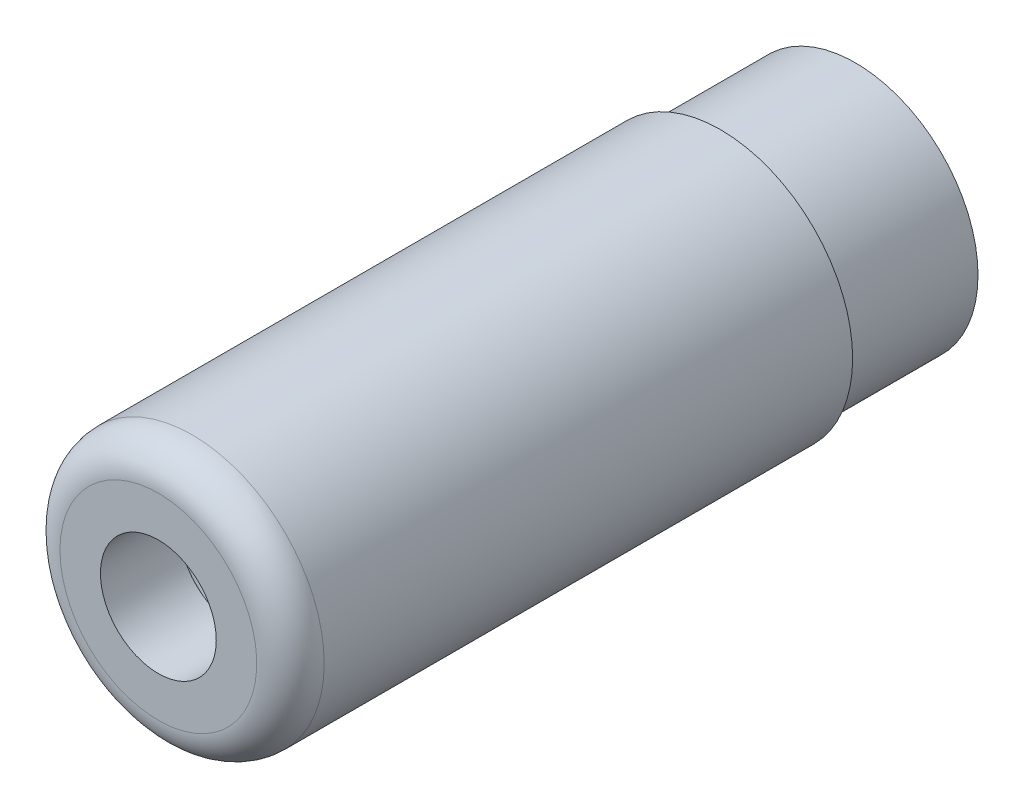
ISO-10303-21;
HEADER;
FILE_DESCRIPTION(('STEP AP214'),'2;1');
FILE_NAME('part.step','',(''),(''),'','','');
FILE_SCHEMA(('AUTOMOTIVE_DESIGN { 1 0 10303 214 1 1 1 1 }'));
ENDSEC;
DATA;
#1=APPLICATION_CONTEXT('core data for automotive mechanical design processes');
#2=APPLICATION_PROTOCOL_DEFINITION('international standard','automotive_design',2000,#1);
#3=PRODUCT_CONTEXT('',#1,'mechanical');
#4=PRODUCT('Part','Part','',(#3));
#5=PRODUCT_RELATED_PRODUCT_CATEGORY('part','',(#4));
#6=PRODUCT_DEFINITION_FORMATION('','',#4);
#7=PRODUCT_DEFINITION_CONTEXT('part definition',#1,'design');
#8=PRODUCT_DEFINITION('design','',#6,#7);
#9=PRODUCT_DEFINITION_SHAPE('','',#8);
#10=(LENGTH_UNIT() NAMED_UNIT(*) SI_UNIT(.MILLI.,.METRE.));
#11=(NAMED_UNIT(*) PLANE_ANGLE_UNIT() SI_UNIT($,.RADIAN.));
#12=(NAMED_UNIT(*) SI_UNIT($,.STERADIAN.) SOLID_ANGLE_UNIT());
#13=UNCERTAINTY_MEASURE_WITH_UNIT(LENGTH_MEASURE(1.E-05),#10,'distance_accuracy_value','');
#14=(GEOMETRIC_REPRESENTATION_CONTEXT(3) GLOBAL_UNCERTAINTY_ASSIGNED_CONTEXT((#13)) GLOBAL_UNIT_ASSIGNED_CONTEXT((#10,
#11,#12)) REPRESENTATION_CONTEXT('',''));
#15=CARTESIAN_POINT('',(0.,0.,0.));
#16=DIRECTION('',(0.,0.,1.));
#17=DIRECTION('',(1.,0.,0.));
#18=AXIS2_PLACEMENT_3D('',#15,#16,#17);
#19=CARTESIAN_POINT('',(0.,0.,7.874));
#20=DIRECTION('',(0.,0.,-1.));
#21=DIRECTION('',(-1.,0.,0.));
#22=AXIS2_PLACEMENT_3D('',#19,#20,#21);
#23=PLANE('',#22);
#24=CARTESIAN_POINT('',(0.,0.,7.874));
#25=DIRECTION('',(0.,0.,-1.));
#26=DIRECTION('',(-1.,0.,0.));
#27=AXIS2_PLACEMENT_3D('',#24,#25,#26);
#28=CIRCLE('',#27,2.2225);
#29=CARTESIAN_POINT('',(-2.2225,0.,7.874));
#30=VERTEX_POINT('',#29);
#31=EDGE_CURVE('E43',#30,#30,#28,.F.);
#32=ORIENTED_EDGE('',*,*,#31,.T.);
#33=EDGE_LOOP('',(#32));
#34=FACE_BOUND('',#33,.T.);
#35=CARTESIAN_POINT('',(0.,0.,7.874));
#36=DIRECTION('',(0.,0.,1.));
#37=DIRECTION('',(1.,0.,0.));
#38=AXIS2_PLACEMENT_3D('',#35,#36,#37);
#39=CIRCLE('',#38,1.30810000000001);
#40=CARTESIAN_POINT('',(1.30810000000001,0.,7.874));
#41=VERTEX_POINT('',#40);
#42=EDGE_CURVE('E52',#41,#41,#39,.T.);
#43=ORIENTED_EDGE('',*,*,#42,.F.);
#44=EDGE_LOOP('',(#43));
#45=FACE_BOUND('',#44,.T.);
#46=ADVANCED_FACE('F29',(#34,#45),#23,.F.);
#47=CARTESIAN_POINT('',(0.,0.,24.1452150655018));
#48=DIRECTION('',(0.,0.,1.));
#49=DIRECTION('',(1.,0.,0.));
#50=AXIS2_PLACEMENT_3D('',#47,#48,#49);
#51=CYLINDRICAL_SURFACE('',#50,2.9845);
#52=CARTESIAN_POINT('',(0.,0.,7.112));
#53=DIRECTION('',(0.,0.,-1.));
#54=DIRECTION('',(-1.,0.,0.));
#55=AXIS2_PLACEMENT_3D('',#52,#53,#54);
#56=CIRCLE('',#55,2.9845);
#57=CARTESIAN_POINT('',(-2.9845,0.,7.112));
#58=VERTEX_POINT('',#57);
#59=EDGE_CURVE('E39',#58,#58,#56,.T.);
#60=ORIENTED_EDGE('',*,*,#59,.T.);
#61=EDGE_LOOP('',(#60));
#62=FACE_BOUND('',#61,.T.);
#63=CARTESIAN_POINT('',(0.,0.,-4.826));
#64=DIRECTION('',(0.,0.,1.));
#65=DIRECTION('',(1.,0.,0.));
#66=AXIS2_PLACEMENT_3D('',#63,#64,#65);
#67=CIRCLE('',#66,2.9845);
#68=CARTESIAN_POINT('',(2.9845,0.,-4.826));
#69=VERTEX_POINT('',#68);
#70=EDGE_CURVE('E48',#69,#69,#67,.T.);
#71=ORIENTED_EDGE('',*,*,#70,.T.);
#72=EDGE_LOOP('',(#71));
#73=FACE_BOUND('',#72,.T.);
#74=ADVANCED_FACE('F84',(#62,#73),#51,.T.);
#75=CARTESIAN_POINT('',(0.,2.9845,-4.826));
#76=DIRECTION('',(0.,0.,1.));
#77=DIRECTION('',(1.,0.,0.));
#78=AXIS2_PLACEMENT_3D('',#75,#76,#77);
#79=PLANE('',#78);
#80=ORIENTED_EDGE('',*,*,#70,.F.);
#81=EDGE_LOOP('',(#80));
#82=FACE_BOUND('',#81,.T.);
#83=CARTESIAN_POINT('',(0.,0.,-4.826));
#84=DIRECTION('',(0.,0.,1.));
#85=DIRECTION('',(1.,0.,0.));
#86=AXIS2_PLACEMENT_3D('',#83,#84,#85);
#87=CIRCLE('',#86,2.7686);
#88=CARTESIAN_POINT('',(2.7686,0.,-4.826));
#89=VERTEX_POINT('',#88);
#90=EDGE_CURVE('E56',#89,#89,#87,.T.);
#91=ORIENTED_EDGE('',*,*,#90,.T.);
#92=EDGE_LOOP('',(#91));
#93=FACE_BOUND('',#92,.T.);
#94=ADVANCED_FACE('F78',(#82,#93),#79,.F.);
#95=CARTESIAN_POINT('',(0.,0.,24.1452150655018));
#96=DIRECTION('',(0.,0.,1.));
#97=DIRECTION('',(1.,0.,0.));
#98=AXIS2_PLACEMENT_3D('',#95,#96,#97);
#99=CYLINDRICAL_SURFACE('',#98,2.7686);
#100=ORIENTED_EDGE('',*,*,#90,.F.);
#101=EDGE_LOOP('',(#100));
#102=FACE_BOUND('',#101,.T.);
#103=CARTESIAN_POINT('',(0.,0.,-7.874));
#104=DIRECTION('',(0.,0.,1.));
#105=DIRECTION('',(1.,0.,0.));
#106=AXIS2_PLACEMENT_3D('',#103,#104,#105);
#107=CIRCLE('',#106,2.7686);
#108=CARTESIAN_POINT('',(2.7686,0.,-7.874));
#109=VERTEX_POINT('',#108);
#110=EDGE_CURVE('E59',#109,#109,#107,.T.);
#111=ORIENTED_EDGE('',*,*,#110,.T.);
#112=EDGE_LOOP('',(#111));
#113=FACE_BOUND('',#112,.T.);
#114=ADVANCED_FACE('F73',(#102,#113),#99,.T.);
#115=CARTESIAN_POINT('',(0.,2.7686,-7.874));
#116=DIRECTION('',(0.,0.,1.));
#117=DIRECTION('',(1.,0.,0.));
#118=AXIS2_PLACEMENT_3D('',#115,#116,#117);
#119=PLANE('',#118);
#120=CARTESIAN_POINT('',(0.,0.,-7.874));
#121=DIRECTION('',(0.,0.,-1.));
#122=DIRECTION('',(-1.,0.,0.));
#123=AXIS2_PLACEMENT_3D('',#120,#121,#122);
#124=CIRCLE('',#123,2.37490000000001);
#125=CARTESIAN_POINT('',(-2.37490000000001,0.,-7.874));
#126=VERTEX_POINT('',#125);
#127=EDGE_CURVE('E53',#126,#126,#124,.T.);
#128=ORIENTED_EDGE('',*,*,#127,.F.);
#129=EDGE_LOOP('',(#128));
#130=FACE_BOUND('',#129,.T.);
#131=ORIENTED_EDGE('',*,*,#110,.F.);
#132=EDGE_LOOP('',(#131));
#133=FACE_BOUND('',#132,.T.);
#134=ADVANCED_FACE('F69',(#130,#133),#119,.F.);
#135=CARTESIAN_POINT('',(0.,0.,7.874));
#136=DIRECTION('',(0.,0.,1.));
#137=DIRECTION('',(1.,0.,0.));
#138=AXIS2_PLACEMENT_3D('',#135,#136,#137);
#139=CYLINDRICAL_SURFACE('',#138,1.30810000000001);
#140=CARTESIAN_POINT('',(0.,0.,6.096));
#141=DIRECTION('',(0.,0.,1.));
#142=DIRECTION('',(1.,0.,0.));
#143=AXIS2_PLACEMENT_3D('',#140,#141,#142);
#144=CIRCLE('',#143,1.30810000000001);
#145=CARTESIAN_POINT('',(1.30810000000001,0.,6.096));
#146=VERTEX_POINT('',#145);
#147=EDGE_CURVE('E49',#146,#146,#144,.F.);
#148=ORIENTED_EDGE('',*,*,#147,.T.);
#149=EDGE_LOOP('',(#148));
#150=FACE_BOUND('',#149,.T.);
#151=ORIENTED_EDGE('',*,*,#42,.T.);
#152=EDGE_LOOP('',(#151));
#153=FACE_BOUND('',#152,.T.);
#154=ADVANCED_FACE('F72',(#150,#153),#139,.F.);
#155=CARTESIAN_POINT('',(0.,0.,6.096));
#156=DIRECTION('',(0.,0.,1.));
#157=DIRECTION('',(1.,0.,0.));
#158=AXIS2_PLACEMENT_3D('',#155,#156,#157);
#159=PLANE('',#158);
#160=CARTESIAN_POINT('',(0.,0.,6.096));
#161=DIRECTION('',(0.,0.,1.));
#162=DIRECTION('',(1.,0.,0.));
#163=AXIS2_PLACEMENT_3D('',#160,#161,#162);
#164=CIRCLE('',#163,1.61290000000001);
#165=CARTESIAN_POINT('',(1.61290000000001,0.,6.096));
#166=VERTEX_POINT('',#165);
#167=EDGE_CURVE('E35',#166,#166,#164,.F.);
#168=ORIENTED_EDGE('',*,*,#167,.T.);
#169=EDGE_LOOP('',(#168));
#170=FACE_BOUND('',#169,.T.);
#171=ORIENTED_EDGE('',*,*,#147,.F.);
#172=EDGE_LOOP('',(#171));
#173=FACE_BOUND('',#172,.T.);
#174=ADVANCED_FACE('F99',(#170,#173),#159,.F.);
#175=CARTESIAN_POINT('',(0.,0.,-7.874));
#176=DIRECTION('',(0.,0.,-1.));
#177=DIRECTION('',(-1.,0.,0.));
#178=AXIS2_PLACEMENT_3D('',#175,#176,#177);
#179=CYLINDRICAL_SURFACE('',#178,2.37490000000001);
#180=CARTESIAN_POINT('',(0.,0.,5.334));
#181=DIRECTION('',(0.,0.,1.));
#182=DIRECTION('',(1.,0.,0.));
#183=AXIS2_PLACEMENT_3D('',#180,#181,#182);
#184=CIRCLE('',#183,2.37490000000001);
#185=CARTESIAN_POINT('',(2.37490000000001,0.,5.334));
#186=VERTEX_POINT('',#185);
#187=EDGE_CURVE('E10',#186,#186,#184,.T.);
#188=ORIENTED_EDGE('',*,*,#187,.T.);
#189=EDGE_LOOP('',(#188));
#190=FACE_BOUND('',#189,.T.);
#191=ORIENTED_EDGE('',*,*,#127,.T.);
#192=EDGE_LOOP('',(#191));
#193=FACE_BOUND('',#192,.T.);
#194=ADVANCED_FACE('F67',(#190,#193),#179,.F.);
#195=CARTESIAN_POINT('',(0.,0.,7.112));
#196=DIRECTION('',(0.,0.,-1.));
#197=DIRECTION('',(-1.,0.,0.));
#198=AXIS2_PLACEMENT_3D('',#195,#196,#197);
#199=TOROIDAL_SURFACE('',#198,2.2225,0.762);
#200=ORIENTED_EDGE('',*,*,#59,.F.);
#201=EDGE_LOOP('',(#200));
#202=FACE_BOUND('',#201,.T.);
#203=ORIENTED_EDGE('',*,*,#31,.F.);
#204=EDGE_LOOP('',(#203));
#205=FACE_BOUND('',#204,.T.);
#206=ADVANCED_FACE('F109',(#202,#205),#199,.T.);
#207=CARTESIAN_POINT('',(0.,0.,5.334));
#208=DIRECTION('',(0.,0.,1.));
#209=DIRECTION('',(1.,0.,0.));
#210=AXIS2_PLACEMENT_3D('',#207,#208,#209);
#211=TOROIDAL_SURFACE('',#210,1.61290000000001,0.762);
#212=ORIENTED_EDGE('',*,*,#187,.F.);
#213=EDGE_LOOP('',(#212));
#214=FACE_BOUND('',#213,.T.);
#215=ORIENTED_EDGE('',*,*,#167,.F.);
#216=EDGE_LOOP('',(#215));
#217=FACE_BOUND('',#216,.T.);
#218=ADVANCED_FACE('F112',(#214,#217),#211,.F.);
#219=CLOSED_SHELL('',(#46,#74,#94,#114,#134,#154,#174,#194,#206,#218));
#220=MANIFOLD_SOLID_BREP('B2',#219);
#221=ADVANCED_BREP_SHAPE_REPRESENTATION('',(#18,#220),#14);
#222=SHAPE_DEFINITION_REPRESENTATION(#9,#221);
ENDSEC;
END-ISO-10303-21;
